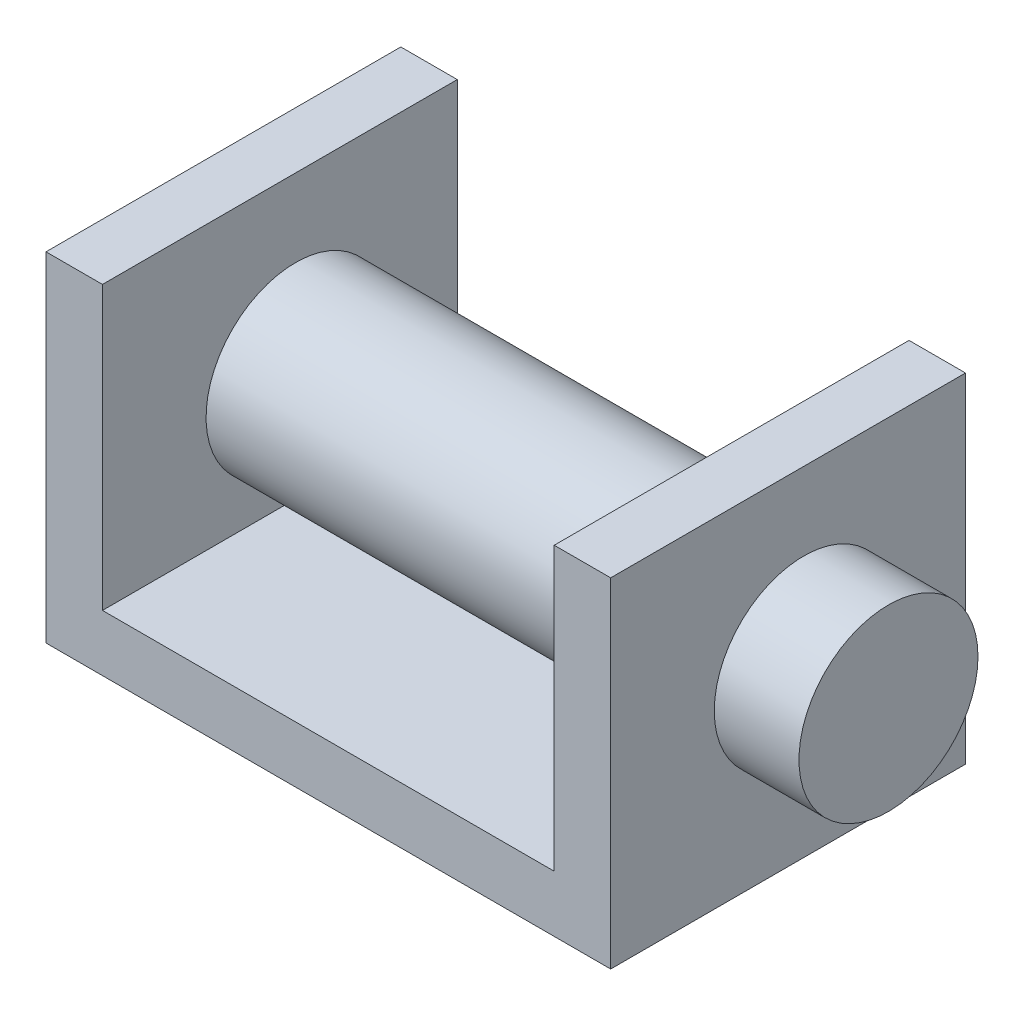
ISO-10303-21;
HEADER;
FILE_DESCRIPTION(('STEP AP214'),'2;1');
FILE_NAME('part.step','',(''),(''),'','','');
FILE_SCHEMA(('AUTOMOTIVE_DESIGN { 1 0 10303 214 1 1 1 1 }'));
ENDSEC;
DATA;
#1=APPLICATION_CONTEXT('core data for automotive mechanical design processes');
#2=APPLICATION_PROTOCOL_DEFINITION('international standard','automotive_design',2000,#1);
#3=PRODUCT_CONTEXT('',#1,'mechanical');
#4=PRODUCT('Part','Part','',(#3));
#5=PRODUCT_RELATED_PRODUCT_CATEGORY('part','',(#4));
#6=PRODUCT_DEFINITION_FORMATION('','',#4);
#7=PRODUCT_DEFINITION_CONTEXT('part definition',#1,'design');
#8=PRODUCT_DEFINITION('design','',#6,#7);
#9=PRODUCT_DEFINITION_SHAPE('','',#8);
#10=(LENGTH_UNIT() NAMED_UNIT(*) SI_UNIT(.MILLI.,.METRE.));
#11=(NAMED_UNIT(*) PLANE_ANGLE_UNIT() SI_UNIT($,.RADIAN.));
#12=(NAMED_UNIT(*) SI_UNIT($,.STERADIAN.) SOLID_ANGLE_UNIT());
#13=UNCERTAINTY_MEASURE_WITH_UNIT(LENGTH_MEASURE(1.E-05),#10,'distance_accuracy_value','');
#14=(GEOMETRIC_REPRESENTATION_CONTEXT(3) GLOBAL_UNCERTAINTY_ASSIGNED_CONTEXT((#13)) GLOBAL_UNIT_ASSIGNED_CONTEXT((#10,
#11,#12)) REPRESENTATION_CONTEXT('',''));
#15=CARTESIAN_POINT('',(0.,0.,0.));
#16=DIRECTION('',(0.,0.,1.));
#17=DIRECTION('',(1.,0.,0.));
#18=AXIS2_PLACEMENT_3D('',#15,#16,#17);
#19=CARTESIAN_POINT('',(-50.,60.,31.4172495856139));
#20=DIRECTION('',(0.,-1.,0.));
#21=DIRECTION('',(0.,0.,-1.));
#22=AXIS2_PLACEMENT_3D('',#19,#20,#21);
#23=PLANE('',#22);
#24=DIRECTION('',(-1.,0.,0.));
#25=VECTOR('',#24,1.);
#26=CARTESIAN_POINT('',(-50.,60.,-31.4172495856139));
#27=LINE('',#26,#25);
#28=CARTESIAN_POINT('',(-40.,60.,-31.4172495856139));
#29=VERTEX_POINT('',#28);
#30=CARTESIAN_POINT('',(-50.,60.,-31.4172495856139));
#31=VERTEX_POINT('',#30);
#32=EDGE_CURVE('E101',#29,#31,#27,.T.);
#33=ORIENTED_EDGE('',*,*,#32,.T.);
#34=DIRECTION('',(0.,0.,-1.));
#35=VECTOR('',#34,1.);
#36=CARTESIAN_POINT('',(-50.,60.,31.4172495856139));
#37=LINE('',#36,#35);
#38=CARTESIAN_POINT('',(-50.,60.,31.4172495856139));
#39=VERTEX_POINT('',#38);
#40=EDGE_CURVE('E11',#39,#31,#37,.T.);
#41=ORIENTED_EDGE('',*,*,#40,.F.);
#42=DIRECTION('',(-1.,0.,0.));
#43=VECTOR('',#42,1.);
#44=CARTESIAN_POINT('',(-50.,60.,31.4172495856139));
#45=LINE('',#44,#43);
#46=CARTESIAN_POINT('',(-40.,60.,31.4172495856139));
#47=VERTEX_POINT('',#46);
#48=EDGE_CURVE('E133',#47,#39,#45,.T.);
#49=ORIENTED_EDGE('',*,*,#48,.F.);
#50=DIRECTION('',(0.,0.,-1.));
#51=VECTOR('',#50,1.);
#52=CARTESIAN_POINT('',(-40.,60.,31.4172495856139));
#53=LINE('',#52,#51);
#54=EDGE_CURVE('E114',#47,#29,#53,.T.);
#55=ORIENTED_EDGE('',*,*,#54,.T.);
#56=EDGE_LOOP('',(#33,#41,#49,#55));
#57=FACE_BOUND('',#56,.T.);
#58=ADVANCED_FACE('F32',(#57),#23,.F.);
#59=CARTESIAN_POINT('',(-50.,60.,31.4172495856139));
#60=DIRECTION('',(1.,0.,0.));
#61=DIRECTION('',(0.,0.,-1.));
#62=AXIS2_PLACEMENT_3D('',#59,#60,#61);
#63=PLANE('',#62);
#64=DIRECTION('',(0.,-1.,0.));
#65=VECTOR('',#64,1.);
#66=CARTESIAN_POINT('',(-50.,60.,-31.4172495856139));
#67=LINE('',#66,#65);
#68=CARTESIAN_POINT('',(-50.,0.,-31.4172495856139));
#69=VERTEX_POINT('',#68);
#70=EDGE_CURVE('E97',#31,#69,#67,.T.);
#71=ORIENTED_EDGE('',*,*,#70,.T.);
#72=DIRECTION('',(0.,0.,-1.));
#73=VECTOR('',#72,1.);
#74=CARTESIAN_POINT('',(-50.,0.,31.4172495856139));
#75=LINE('',#74,#73);
#76=CARTESIAN_POINT('',(-50.,0.,31.4172495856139));
#77=VERTEX_POINT('',#76);
#78=EDGE_CURVE('E40',#77,#69,#75,.T.);
#79=ORIENTED_EDGE('',*,*,#78,.F.);
#80=DIRECTION('',(0.,-1.,0.));
#81=VECTOR('',#80,1.);
#82=CARTESIAN_POINT('',(-50.,60.,31.4172495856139));
#83=LINE('',#82,#81);
#84=EDGE_CURVE('E110',#39,#77,#83,.T.);
#85=ORIENTED_EDGE('',*,*,#84,.F.);
#86=ORIENTED_EDGE('',*,*,#40,.T.);
#87=EDGE_LOOP('',(#71,#79,#85,#86));
#88=FACE_BOUND('',#87,.T.);
#89=ADVANCED_FACE('F109',(#88),#63,.F.);
#90=CARTESIAN_POINT('',(-50.,0.,31.4172495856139));
#91=DIRECTION('',(0.,1.,0.));
#92=DIRECTION('',(0.,0.,1.));
#93=AXIS2_PLACEMENT_3D('',#90,#91,#92);
#94=PLANE('',#93);
#95=DIRECTION('',(1.,0.,0.));
#96=VECTOR('',#95,1.);
#97=CARTESIAN_POINT('',(-50.,0.,-31.4172495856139));
#98=LINE('',#97,#96);
#99=CARTESIAN_POINT('',(50.,0.,-31.4172495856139));
#100=VERTEX_POINT('',#99);
#101=EDGE_CURVE('E103',#69,#100,#98,.T.);
#102=ORIENTED_EDGE('',*,*,#101,.T.);
#103=DIRECTION('',(0.,0.,-1.));
#104=VECTOR('',#103,1.);
#105=CARTESIAN_POINT('',(50.,0.,31.4172495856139));
#106=LINE('',#105,#104);
#107=CARTESIAN_POINT('',(50.,0.,31.4172495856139));
#108=VERTEX_POINT('',#107);
#109=EDGE_CURVE('E159',#108,#100,#106,.T.);
#110=ORIENTED_EDGE('',*,*,#109,.F.);
#111=DIRECTION('',(1.,0.,0.));
#112=VECTOR('',#111,1.);
#113=CARTESIAN_POINT('',(-50.,0.,31.4172495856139));
#114=LINE('',#113,#112);
#115=EDGE_CURVE('E136',#77,#108,#114,.T.);
#116=ORIENTED_EDGE('',*,*,#115,.F.);
#117=ORIENTED_EDGE('',*,*,#78,.T.);
#118=EDGE_LOOP('',(#102,#110,#116,#117));
#119=FACE_BOUND('',#118,.T.);
#120=ADVANCED_FACE('F164',(#119),#94,.F.);
#121=CARTESIAN_POINT('',(50.,0.,31.4172495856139));
#122=DIRECTION('',(-1.,0.,0.));
#123=DIRECTION('',(0.,0.,1.));
#124=AXIS2_PLACEMENT_3D('',#121,#122,#123);
#125=PLANE('',#124);
#126=CARTESIAN_POINT('',(50.,30.4041294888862,-2.78003489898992));
#127=DIRECTION('',(-1.,0.,0.));
#128=DIRECTION('',(0.,0.,1.));
#129=AXIS2_PLACEMENT_3D('',#126,#127,#128);
#130=CIRCLE('',#129,15.8522661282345);
#131=CARTESIAN_POINT('',(50.,30.4041294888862,13.0722312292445));
#132=VERTEX_POINT('',#131);
#133=EDGE_CURVE('E115',#132,#132,#130,.T.);
#134=ORIENTED_EDGE('',*,*,#133,.T.);
#135=EDGE_LOOP('',(#134));
#136=FACE_BOUND('',#135,.T.);
#137=DIRECTION('',(0.,1.,0.));
#138=VECTOR('',#137,1.);
#139=CARTESIAN_POINT('',(50.,0.,-31.4172495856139));
#140=LINE('',#139,#138);
#141=CARTESIAN_POINT('',(50.,60.,-31.4172495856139));
#142=VERTEX_POINT('',#141);
#143=EDGE_CURVE('E123',#100,#142,#140,.T.);
#144=ORIENTED_EDGE('',*,*,#143,.T.);
#145=DIRECTION('',(0.,0.,-1.));
#146=VECTOR('',#145,1.);
#147=CARTESIAN_POINT('',(50.,60.,31.4172495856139));
#148=LINE('',#147,#146);
#149=CARTESIAN_POINT('',(50.,60.,31.4172495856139));
#150=VERTEX_POINT('',#149);
#151=EDGE_CURVE('E156',#150,#142,#148,.T.);
#152=ORIENTED_EDGE('',*,*,#151,.F.);
#153=DIRECTION('',(0.,1.,0.));
#154=VECTOR('',#153,1.);
#155=CARTESIAN_POINT('',(50.,0.,31.4172495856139));
#156=LINE('',#155,#154);
#157=EDGE_CURVE('E138',#108,#150,#156,.T.);
#158=ORIENTED_EDGE('',*,*,#157,.F.);
#159=ORIENTED_EDGE('',*,*,#109,.T.);
#160=EDGE_LOOP('',(#144,#152,#158,#159));
#161=FACE_BOUND('',#160,.T.);
#162=ADVANCED_FACE('F172',(#136,#161),#125,.F.);
#163=CARTESIAN_POINT('',(40.,60.,31.4172495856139));
#164=DIRECTION('',(0.,-1.,0.));
#165=DIRECTION('',(0.,0.,-1.));
#166=AXIS2_PLACEMENT_3D('',#163,#164,#165);
#167=PLANE('',#166);
#168=DIRECTION('',(-1.,0.,0.));
#169=VECTOR('',#168,1.);
#170=CARTESIAN_POINT('',(40.,60.,-31.4172495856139));
#171=LINE('',#170,#169);
#172=CARTESIAN_POINT('',(40.,60.,-31.4172495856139));
#173=VERTEX_POINT('',#172);
#174=EDGE_CURVE('E125',#142,#173,#171,.T.);
#175=ORIENTED_EDGE('',*,*,#174,.T.);
#176=DIRECTION('',(0.,0.,-1.));
#177=VECTOR('',#176,1.);
#178=CARTESIAN_POINT('',(40.,60.,31.4172495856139));
#179=LINE('',#178,#177);
#180=CARTESIAN_POINT('',(40.,60.,31.4172495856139));
#181=VERTEX_POINT('',#180);
#182=EDGE_CURVE('E153',#181,#173,#179,.T.);
#183=ORIENTED_EDGE('',*,*,#182,.F.);
#184=DIRECTION('',(-1.,0.,0.));
#185=VECTOR('',#184,1.);
#186=CARTESIAN_POINT('',(40.,60.,31.4172495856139));
#187=LINE('',#186,#185);
#188=EDGE_CURVE('E140',#150,#181,#187,.T.);
#189=ORIENTED_EDGE('',*,*,#188,.F.);
#190=ORIENTED_EDGE('',*,*,#151,.T.);
#191=EDGE_LOOP('',(#175,#183,#189,#190));
#192=FACE_BOUND('',#191,.T.);
#193=ADVANCED_FACE('F175',(#192),#167,.F.);
#194=CARTESIAN_POINT('',(40.,10.,31.4172495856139));
#195=DIRECTION('',(1.,0.,0.));
#196=DIRECTION('',(0.,0.,-1.));
#197=AXIS2_PLACEMENT_3D('',#194,#195,#196);
#198=PLANE('',#197);
#199=CARTESIAN_POINT('',(40.,30.4041294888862,-2.78003489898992));
#200=DIRECTION('',(1.,0.,0.));
#201=DIRECTION('',(0.,0.,-1.));
#202=AXIS2_PLACEMENT_3D('',#199,#200,#201);
#203=CIRCLE('',#202,15.8522661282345);
#204=CARTESIAN_POINT('',(40.,30.4041294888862,-18.6323010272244));
#205=VERTEX_POINT('',#204);
#206=EDGE_CURVE('E118',#205,#205,#203,.T.);
#207=ORIENTED_EDGE('',*,*,#206,.T.);
#208=EDGE_LOOP('',(#207));
#209=FACE_BOUND('',#208,.T.);
#210=DIRECTION('',(0.,-1.,0.));
#211=VECTOR('',#210,1.);
#212=CARTESIAN_POINT('',(40.,10.,-31.4172495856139));
#213=LINE('',#212,#211);
#214=CARTESIAN_POINT('',(40.,10.,-31.4172495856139));
#215=VERTEX_POINT('',#214);
#216=EDGE_CURVE('E127',#173,#215,#213,.T.);
#217=ORIENTED_EDGE('',*,*,#216,.T.);
#218=DIRECTION('',(0.,0.,-1.));
#219=VECTOR('',#218,1.);
#220=CARTESIAN_POINT('',(40.,10.,31.4172495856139));
#221=LINE('',#220,#219);
#222=CARTESIAN_POINT('',(40.,10.,31.4172495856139));
#223=VERTEX_POINT('',#222);
#224=EDGE_CURVE('E150',#223,#215,#221,.T.);
#225=ORIENTED_EDGE('',*,*,#224,.F.);
#226=DIRECTION('',(0.,-1.,0.));
#227=VECTOR('',#226,1.);
#228=CARTESIAN_POINT('',(40.,10.,31.4172495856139));
#229=LINE('',#228,#227);
#230=EDGE_CURVE('E142',#181,#223,#229,.T.);
#231=ORIENTED_EDGE('',*,*,#230,.F.);
#232=ORIENTED_EDGE('',*,*,#182,.T.);
#233=EDGE_LOOP('',(#217,#225,#231,#232));
#234=FACE_BOUND('',#233,.T.);
#235=ADVANCED_FACE('F180',(#209,#234),#198,.F.);
#236=CARTESIAN_POINT('',(-40.,10.,31.4172495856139));
#237=DIRECTION('',(0.,-1.,0.));
#238=DIRECTION('',(0.,0.,-1.));
#239=AXIS2_PLACEMENT_3D('',#236,#237,#238);
#240=PLANE('',#239);
#241=DIRECTION('',(-1.,0.,0.));
#242=VECTOR('',#241,1.);
#243=CARTESIAN_POINT('',(-40.,10.,-31.4172495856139));
#244=LINE('',#243,#242);
#245=CARTESIAN_POINT('',(-40.,10.,-31.4172495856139));
#246=VERTEX_POINT('',#245);
#247=EDGE_CURVE('E129',#215,#246,#244,.T.);
#248=ORIENTED_EDGE('',*,*,#247,.T.);
#249=DIRECTION('',(0.,0.,-1.));
#250=VECTOR('',#249,1.);
#251=CARTESIAN_POINT('',(-40.,10.,31.4172495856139));
#252=LINE('',#251,#250);
#253=CARTESIAN_POINT('',(-40.,10.,31.4172495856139));
#254=VERTEX_POINT('',#253);
#255=EDGE_CURVE('E147',#254,#246,#252,.T.);
#256=ORIENTED_EDGE('',*,*,#255,.F.);
#257=DIRECTION('',(-1.,0.,0.));
#258=VECTOR('',#257,1.);
#259=CARTESIAN_POINT('',(-40.,10.,31.4172495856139));
#260=LINE('',#259,#258);
#261=EDGE_CURVE('E52',#223,#254,#260,.T.);
#262=ORIENTED_EDGE('',*,*,#261,.F.);
#263=ORIENTED_EDGE('',*,*,#224,.T.);
#264=EDGE_LOOP('',(#248,#256,#262,#263));
#265=FACE_BOUND('',#264,.T.);
#266=ADVANCED_FACE('F183',(#265),#240,.F.);
#267=CARTESIAN_POINT('',(-40.,60.,31.4172495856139));
#268=DIRECTION('',(-1.,0.,0.));
#269=DIRECTION('',(0.,-1.,0.));
#270=AXIS2_PLACEMENT_3D('',#267,#268,#269);
#271=PLANE('',#270);
#272=CARTESIAN_POINT('',(-40.,30.4041294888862,-2.78003489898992));
#273=DIRECTION('',(-1.,0.,0.));
#274=DIRECTION('',(0.,-1.,0.));
#275=AXIS2_PLACEMENT_3D('',#272,#273,#274);
#276=CIRCLE('',#275,15.8522661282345);
#277=CARTESIAN_POINT('',(-40.,14.5518633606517,-2.78003489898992));
#278=VERTEX_POINT('',#277);
#279=EDGE_CURVE('E35',#278,#278,#276,.T.);
#280=ORIENTED_EDGE('',*,*,#279,.T.);
#281=EDGE_LOOP('',(#280));
#282=FACE_BOUND('',#281,.T.);
#283=DIRECTION('',(0.,1.,0.));
#284=VECTOR('',#283,1.);
#285=CARTESIAN_POINT('',(-40.,60.,-31.4172495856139));
#286=LINE('',#285,#284);
#287=EDGE_CURVE('E131',#246,#29,#286,.T.);
#288=ORIENTED_EDGE('',*,*,#287,.T.);
#289=ORIENTED_EDGE('',*,*,#54,.F.);
#290=DIRECTION('',(0.,1.,0.));
#291=VECTOR('',#290,1.);
#292=CARTESIAN_POINT('',(-40.,60.,31.4172495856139));
#293=LINE('',#292,#291);
#294=EDGE_CURVE('E47',#254,#47,#293,.T.);
#295=ORIENTED_EDGE('',*,*,#294,.F.);
#296=ORIENTED_EDGE('',*,*,#255,.T.);
#297=EDGE_LOOP('',(#288,#289,#295,#296));
#298=FACE_BOUND('',#297,.T.);
#299=ADVANCED_FACE('F185',(#282,#298),#271,.F.);
#300=CARTESIAN_POINT('',(40.,60.,31.4172495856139));
#301=DIRECTION('',(0.,0.,1.));
#302=DIRECTION('',(1.,0.,0.));
#303=AXIS2_PLACEMENT_3D('',#300,#301,#302);
#304=PLANE('',#303);
#305=ORIENTED_EDGE('',*,*,#48,.T.);
#306=ORIENTED_EDGE('',*,*,#84,.T.);
#307=ORIENTED_EDGE('',*,*,#115,.T.);
#308=ORIENTED_EDGE('',*,*,#157,.T.);
#309=ORIENTED_EDGE('',*,*,#188,.T.);
#310=ORIENTED_EDGE('',*,*,#230,.T.);
#311=ORIENTED_EDGE('',*,*,#261,.T.);
#312=ORIENTED_EDGE('',*,*,#294,.T.);
#313=EDGE_LOOP('',(#305,#306,#307,#308,#309,#310,#311,#312));
#314=FACE_BOUND('',#313,.T.);
#315=ADVANCED_FACE('F167',(#314),#304,.T.);
#316=CARTESIAN_POINT('',(40.,60.,-31.4172495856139));
#317=DIRECTION('',(0.,0.,1.));
#318=DIRECTION('',(1.,0.,0.));
#319=AXIS2_PLACEMENT_3D('',#316,#317,#318);
#320=PLANE('',#319);
#321=ORIENTED_EDGE('',*,*,#32,.F.);
#322=ORIENTED_EDGE('',*,*,#287,.F.);
#323=ORIENTED_EDGE('',*,*,#247,.F.);
#324=ORIENTED_EDGE('',*,*,#216,.F.);
#325=ORIENTED_EDGE('',*,*,#174,.F.);
#326=ORIENTED_EDGE('',*,*,#143,.F.);
#327=ORIENTED_EDGE('',*,*,#101,.F.);
#328=ORIENTED_EDGE('',*,*,#70,.F.);
#329=EDGE_LOOP('',(#321,#322,#323,#324,#325,#326,#327,#328));
#330=FACE_BOUND('',#329,.T.);
#331=ADVANCED_FACE('F98',(#330),#320,.F.);
#332=CARTESIAN_POINT('',(-50.,30.4041294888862,-2.78003489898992));
#333=DIRECTION('',(1.,0.,0.));
#334=DIRECTION('',(0.,0.,-1.));
#335=AXIS2_PLACEMENT_3D('',#332,#333,#334);
#336=CYLINDRICAL_SURFACE('',#335,15.8522661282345);
#337=ORIENTED_EDGE('',*,*,#279,.F.);
#338=EDGE_LOOP('',(#337));
#339=FACE_BOUND('',#338,.T.);
#340=ORIENTED_EDGE('',*,*,#206,.F.);
#341=EDGE_LOOP('',(#340));
#342=FACE_BOUND('',#341,.T.);
#343=ADVANCED_FACE('F227',(#339,#342),#336,.T.);
#344=CARTESIAN_POINT('',(65.,30.4041294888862,-2.78003489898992));
#345=DIRECTION('',(1.,0.,0.));
#346=DIRECTION('',(0.,0.,-1.));
#347=AXIS2_PLACEMENT_3D('',#344,#345,#346);
#348=CIRCLE('',#347,15.8522661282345);
#349=CARTESIAN_POINT('',(65.,30.4041294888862,-18.6323010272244));
#350=VERTEX_POINT('',#349);
#351=EDGE_CURVE('E217',#350,#350,#348,.T.);
#352=ORIENTED_EDGE('',*,*,#351,.F.);
#353=EDGE_LOOP('',(#352));
#354=FACE_BOUND('',#353,.T.);
#355=ORIENTED_EDGE('',*,*,#133,.F.);
#356=EDGE_LOOP('',(#355));
#357=FACE_BOUND('',#356,.T.);
#358=ADVANCED_FACE('F224',(#354,#357),#336,.T.);
#359=CARTESIAN_POINT('',(65.,30.4041294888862,-2.78003489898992));
#360=DIRECTION('',(1.,0.,0.));
#361=DIRECTION('',(0.,0.,-1.));
#362=AXIS2_PLACEMENT_3D('',#359,#360,#361);
#363=PLANE('',#362);
#364=ORIENTED_EDGE('',*,*,#351,.T.);
#365=EDGE_LOOP('',(#364));
#366=FACE_BOUND('',#365,.T.);
#367=ADVANCED_FACE('F222',(#366),#363,.T.);
#368=CLOSED_SHELL('',(#58,#89,#120,#162,#193,#235,#266,#299,#315,#331,#343,#358,#367));
#369=MANIFOLD_SOLID_BREP('B2',#368);
#370=ADVANCED_BREP_SHAPE_REPRESENTATION('',(#18,#369),#14);
#371=SHAPE_DEFINITION_REPRESENTATION(#9,#370);
ENDSEC;
END-ISO-10303-21;
